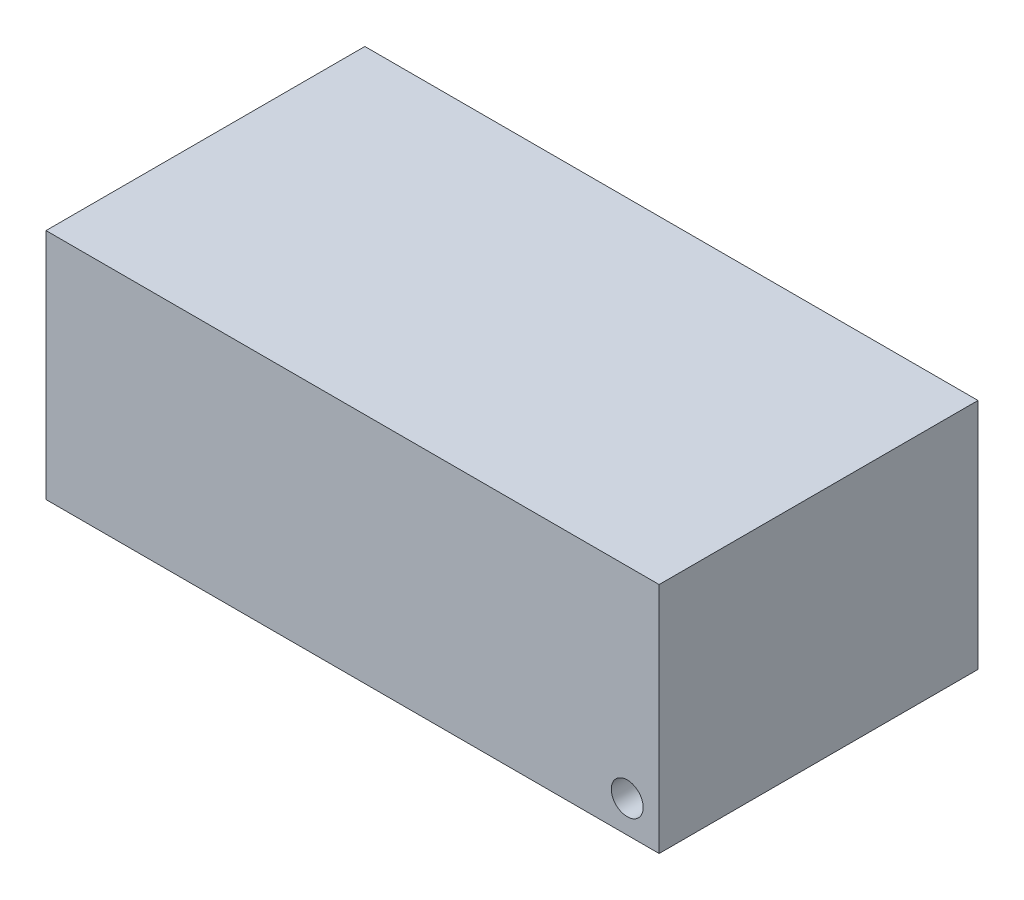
from build123d import *

# Parameters (mm, degrees)
SKIZZE1_W               = 96.142746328
SKIZZE1_H               = 36.528535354
LINEAR_AUSTRAGEN1_DEPTH = 50
SKIZZE2_R               = 2.5
LINEAR_AUSTRAGEN2_DEPTH = 72.724754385


with BuildPart() as part:
    # Skizze1 → Linear austragen1 (new body)
    with BuildSketch(Plane.XY):
        Rectangle(SKIZZE1_W, SKIZZE1_H)
    extrude(amount=LINEAR_AUSTRAGEN1_DEPTH)

    # Skizze2 → Linear austragen2 (cut, through all)
    with BuildSketch(Plane.XY.offset(50)):
        with Locations((43.071373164, -13.264267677)):
            Circle(SKIZZE2_R)
    extrude(amount=-LINEAR_AUSTRAGEN2_DEPTH, mode=Mode.SUBTRACT)


solid = part.part
